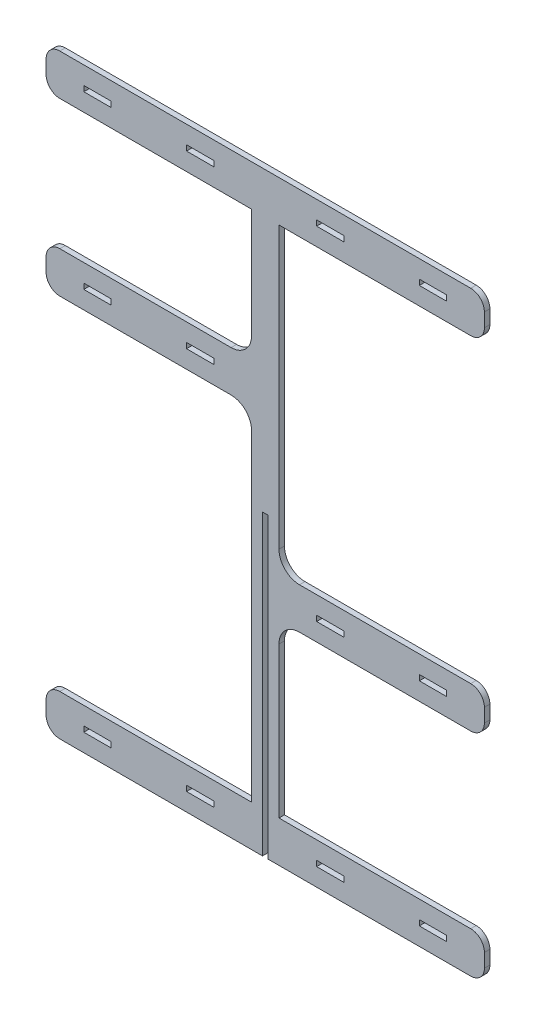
from build123d import *

# Parameters (mm, degrees)
CROQUIS1_W                 = 320
CROQUIS1_H                 = 30
CROQUIS1_W_2               = 20
CROQUIS1_H_2               = 4
SALIENTE_EXTRUIR1_DEPTH    = 2
CROQUIS2_W                 = 20
CROQUIS2_H                 = 4
SALIENTE_EXTRUIR2_DEPTH    = 2
REDONDEO1_R                = 10
REDONDEO2_R                = 10
MATRIZL2_COUNT             = 2
MATRIZL2_PITCH             = 405
REDONDEO2_OF_MATRIZL2_R    = 10
CORTAR_EXTRUIR1_DEPTH      = 541.026851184
CORTAR_EXTRUIR1_DEPTH_BACK = 541.026851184
CROQUIS3_W                 = 4
CROQUIS3_H                 = 217.5


with BuildPart() as part:
    # Croquis1 → Saliente-Extruir1 (new, symmetric)
    with BuildSketch(Plane.XY):
        with Locations((160, 15)):
            Rectangle(CROQUIS1_W, CROQUIS1_H)
        with Locations((37.5, 15)):
            Rectangle(CROQUIS1_W_2, CROQUIS1_H_2, mode=Mode.SUBTRACT)
        with Locations((112.5, 15)):
            Rectangle(CROQUIS1_W_2, CROQUIS1_H_2, mode=Mode.SUBTRACT)
        with Locations((207.5, 15)):
            Rectangle(CROQUIS1_W_2, CROQUIS1_H_2, mode=Mode.SUBTRACT)
        with Locations((282.5, 15)):
            Rectangle(CROQUIS1_W_2, CROQUIS1_H_2, mode=Mode.SUBTRACT)
    saliente_extruir1 = extrude(amount=SALIENTE_EXTRUIR1_DEPTH, both=True)

    # Croquis2 → Saliente-Extruir2 (add, symmetric)
    with BuildSketch(Plane.XY):
        with BuildLine():
            Line((170, 30), (170, 140))
            ThreePointArc((170, 140), (174.393398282, 150.606601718), (185, 155))
            Line((185, 155), (320, 155))
            Line((320, 155), (320, 185))
            Line((320, 185), (185, 185))
            ThreePointArc((185, 185), (174.393398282, 189.393398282), (170, 200))
            Line((170, 200), (170, 435))
            Line((170, 435), (150, 435))
            Line((150, 435), (150, 325))
            ThreePointArc((150, 325), (145.606601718, 314.393398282), (135, 310))
            Line((135, 310), (0, 310))
            Line((0, 310), (0, 280))
            Line((0, 280), (135, 280))
            ThreePointArc((135, 280), (145.606601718, 275.606601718), (150, 265))
            Line((150, 265), (150, 30))
            Line((150, 30), (170, 30))
        make_face()
        with Locations((112.5, 295)):
            Rectangle(CROQUIS2_W, CROQUIS2_H, mode=Mode.SUBTRACT)
        with Locations((37.5, 295)):
            Rectangle(CROQUIS2_W, CROQUIS2_H, mode=Mode.SUBTRACT)
        with Locations((282.5, 170)):
            Rectangle(CROQUIS2_W, CROQUIS2_H, mode=Mode.SUBTRACT)
        with Locations((207.5, 170)):
            Rectangle(CROQUIS2_W, CROQUIS2_H, mode=Mode.SUBTRACT)
    extrude(amount=SALIENTE_EXTRUIR2_DEPTH, both=True)

    # Redondeo1
    redondeo1_edges = [part.edges().sort_by_distance(p)[0] for p in [
        (320, 155, 0),
        (320, 185, 0),
        (0, 310, 0),
        (0, 280, 0),
    ]]
    fillet(redondeo1_edges, radius=REDONDEO1_R)

    # Redondeo2
    redondeo2_edges = [part.edges().sort_by_distance(p)[0] for p in [
        (0, 0, 0),
        (0, 30, 0),
        (320, 30, 0),
        (320, 0, 0),
    ]]
    fillet(redondeo2_edges, radius=REDONDEO2_R)

    # MatrizL2: Saliente-Extruir1 ×2
    with Locations(*[(0, i * MATRIZL2_PITCH, 0) for i in range(1, MATRIZL2_COUNT)]):
        add(saliente_extruir1)

    # Redondeo2 of MatrizL2
    redondeo2_of_matrizl2_edges = [part.edges().sort_by_distance(p)[0] for p in [
        (0, 405, 0),
        (0, 435, 0),
        (320, 435, 0),
        (320, 405, 0),
    ]]
    fillet(redondeo2_of_matrizl2_edges, radius=REDONDEO2_OF_MATRIZL2_R)

    # Croquis3 → Cortar-Extruir1 (cut, two sides: drawn at the far end of the back side and taken through both)
    with BuildSketch(Plane.XY.offset(-CORTAR_EXTRUIR1_DEPTH_BACK)):
        with Locations((160, 108.75)):
            Rectangle(CROQUIS3_W, CROQUIS3_H)
    extrude(amount=CORTAR_EXTRUIR1_DEPTH + CORTAR_EXTRUIR1_DEPTH_BACK, mode=Mode.SUBTRACT)


solid = part.part
